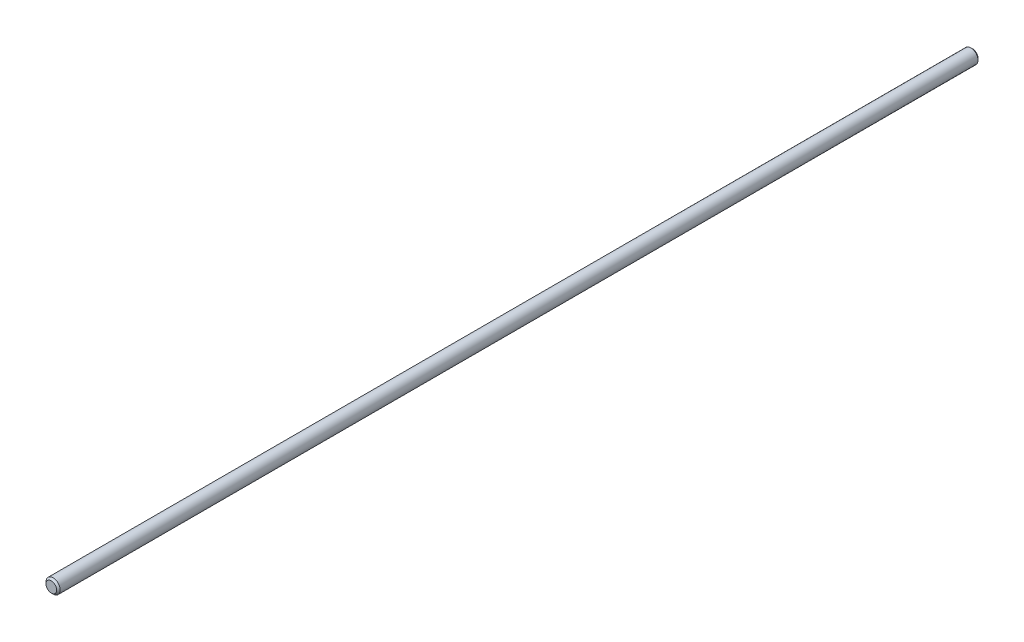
from build123d import *

# Parameters (mm, degrees)
SKETCH_1_R      = 2
EXTRUDE_1_DEPTH = 260
CHAMFER_1_SIZE  = 0.5


with BuildPart() as part:
    # Sketch 1 → Extrude 1 (new body)
    with BuildSketch(Plane.XY):
        Circle(SKETCH_1_R)
    extrude(amount=-EXTRUDE_1_DEPTH)

    # Chamfer 1
    chamfer_1_edges = [part.edges().sort_by_distance(p)[0] for p in [
        (-2, 0, 0),
        (-2, 0, -260),
    ]]
    chamfer(chamfer_1_edges, length=CHAMFER_1_SIZE)


solid = part.part
